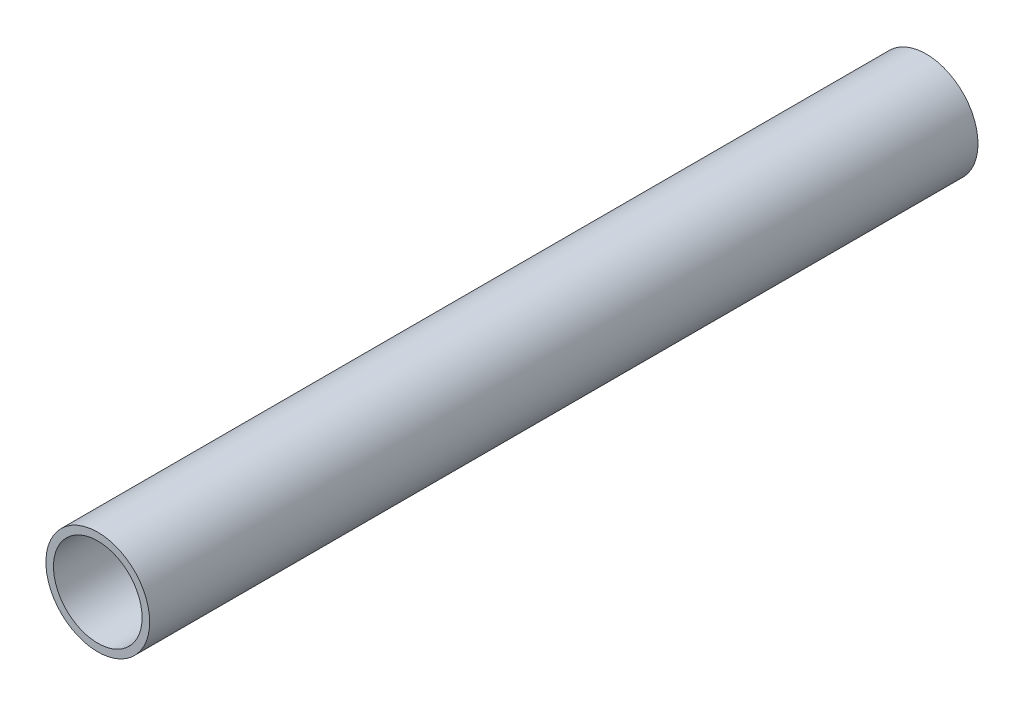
from build123d import *

# Parameters (mm, degrees)
SKETCH1_R          = 19.0881
BASE_EXTRUDE_DEPTH = 1474.47
SKETCH2_R          = 16.301641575
CUT_EXTRUDE1_DEPTH = 1475.717088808
SKETCH3_R          = 25.4
CUT_EXTRUDE2_DEPTH = 866.291181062
SKETCH4_R          = 22.130924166
CUT_EXTRUDE3_DEPTH = 306.993057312


with BuildPart() as part:
    # Sketch1 → Base-Extrude (new body)
    with BuildSketch(Plane.XY):
        Circle(SKETCH1_R)
    extrude(amount=BASE_EXTRUDE_DEPTH)

    # Sketch2 → Cut-Extrude1 (cut, through all)
    with BuildSketch(Plane.XY.offset(1474.47)):
        Circle(SKETCH2_R)
    extrude(amount=-CUT_EXTRUDE1_DEPTH, mode=Mode.SUBTRACT)

    # Sketch3 → Cut-Extrude2 (cut, through all)
    with BuildSketch(Plane.XY.offset(609.6)):
        Circle(SKETCH3_R)
    extrude(amount=CUT_EXTRUDE2_DEPTH, mode=Mode.SUBTRACT)

    # Sketch4 → Cut-Extrude3 (cut, through all)
    with BuildSketch(Plane.XY.offset(304.8)):
        Circle(SKETCH4_R)
    extrude(amount=-CUT_EXTRUDE3_DEPTH, mode=Mode.SUBTRACT)


solid = part.part
